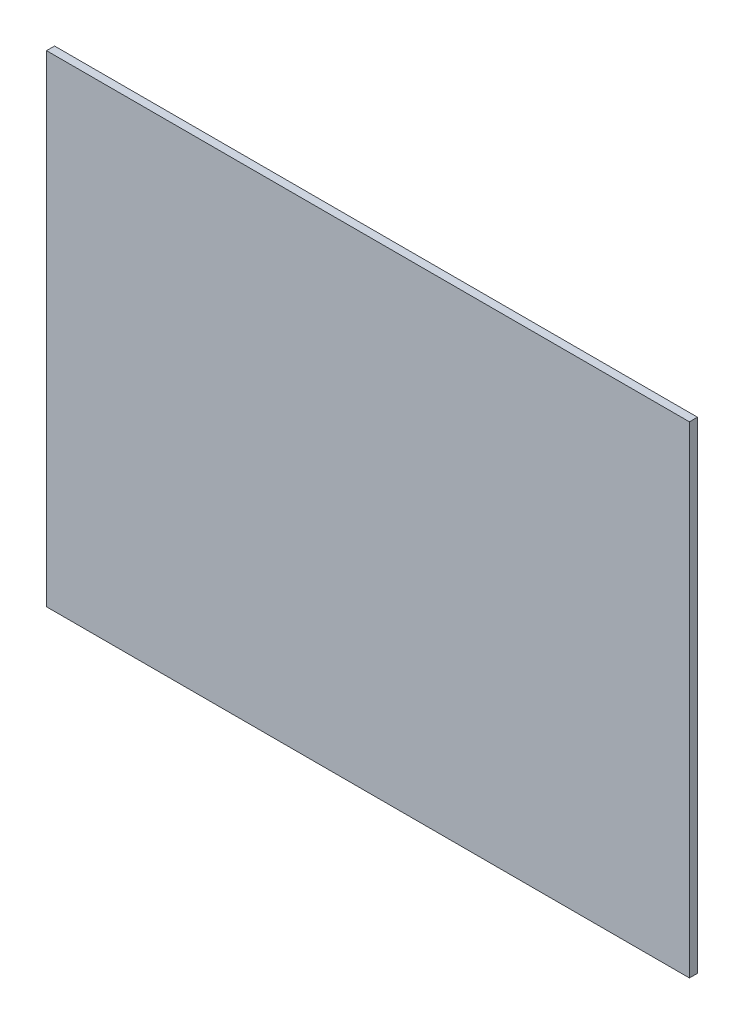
ISO-10303-21;
HEADER;
FILE_DESCRIPTION(('STEP AP214'),'2;1');
FILE_NAME('part.step','',(''),(''),'','','');
FILE_SCHEMA(('AUTOMOTIVE_DESIGN { 1 0 10303 214 1 1 1 1 }'));
ENDSEC;
DATA;
#1=APPLICATION_CONTEXT('core data for automotive mechanical design processes');
#2=APPLICATION_PROTOCOL_DEFINITION('international standard','automotive_design',2000,#1);
#3=PRODUCT_CONTEXT('',#1,'mechanical');
#4=PRODUCT('Part','Part','',(#3));
#5=PRODUCT_RELATED_PRODUCT_CATEGORY('part','',(#4));
#6=PRODUCT_DEFINITION_FORMATION('','',#4);
#7=PRODUCT_DEFINITION_CONTEXT('part definition',#1,'design');
#8=PRODUCT_DEFINITION('design','',#6,#7);
#9=PRODUCT_DEFINITION_SHAPE('','',#8);
#10=(LENGTH_UNIT() NAMED_UNIT(*) SI_UNIT(.MILLI.,.METRE.));
#11=(NAMED_UNIT(*) PLANE_ANGLE_UNIT() SI_UNIT($,.RADIAN.));
#12=(NAMED_UNIT(*) SI_UNIT($,.STERADIAN.) SOLID_ANGLE_UNIT());
#13=UNCERTAINTY_MEASURE_WITH_UNIT(LENGTH_MEASURE(1.E-05),#10,'distance_accuracy_value','');
#14=(GEOMETRIC_REPRESENTATION_CONTEXT(3) GLOBAL_UNCERTAINTY_ASSIGNED_CONTEXT((#13)) GLOBAL_UNIT_ASSIGNED_CONTEXT((#10,
#11,#12)) REPRESENTATION_CONTEXT('',''));
#15=CARTESIAN_POINT('',(0.,0.,0.));
#16=DIRECTION('',(0.,0.,1.));
#17=DIRECTION('',(1.,0.,0.));
#18=AXIS2_PLACEMENT_3D('',#15,#16,#17);
#19=CARTESIAN_POINT('',(0.40005254,0.29972254,0.));
#20=DIRECTION('',(1.,0.,0.));
#21=DIRECTION('',(0.,1.,0.));
#22=AXIS2_PLACEMENT_3D('',#19,#20,#21);
#23=PLANE('',#22);
#24=DIRECTION('',(0.,0.,1.));
#25=VECTOR('',#24,1.);
#26=CARTESIAN_POINT('',(0.40005254,0.29972254,0.));
#27=LINE('',#26,#25);
#28=CARTESIAN_POINT('',(0.40005254,0.29972254,0.));
#29=VERTEX_POINT('',#28);
#30=CARTESIAN_POINT('',(0.40005254,0.29972254,0.00999998));
#31=VERTEX_POINT('',#30);
#32=EDGE_CURVE('E11',#29,#31,#27,.T.);
#33=ORIENTED_EDGE('',*,*,#32,.T.);
#34=DIRECTION('',(0.,-1.,0.));
#35=VECTOR('',#34,1.);
#36=CARTESIAN_POINT('',(0.40005254,0.29972254,0.00999998));
#37=LINE('',#36,#35);
#38=CARTESIAN_POINT('',(0.40005254,-0.29972,0.00999998));
#39=VERTEX_POINT('',#38);
#40=EDGE_CURVE('E45',#31,#39,#37,.T.);
#41=ORIENTED_EDGE('',*,*,#40,.T.);
#42=DIRECTION('',(0.,0.,1.));
#43=VECTOR('',#42,1.);
#44=CARTESIAN_POINT('',(0.40005254,-0.29972,0.));
#45=LINE('',#44,#43);
#46=CARTESIAN_POINT('',(0.40005254,-0.29972,0.));
#47=VERTEX_POINT('',#46);
#48=EDGE_CURVE('E85',#47,#39,#45,.T.);
#49=ORIENTED_EDGE('',*,*,#48,.F.);
#50=DIRECTION('',(0.,-1.,0.));
#51=VECTOR('',#50,1.);
#52=CARTESIAN_POINT('',(0.40005254,0.29972254,0.));
#53=LINE('',#52,#51);
#54=EDGE_CURVE('E80',#29,#47,#53,.T.);
#55=ORIENTED_EDGE('',*,*,#54,.F.);
#56=EDGE_LOOP('',(#33,#41,#49,#55));
#57=FACE_BOUND('',#56,.T.);
#58=ADVANCED_FACE('F17',(#57),#23,.T.);
#59=CARTESIAN_POINT('',(-0.40005,0.29972254,0.));
#60=DIRECTION('',(0.,1.,0.));
#61=DIRECTION('',(1.,0.,0.));
#62=AXIS2_PLACEMENT_3D('',#59,#60,#61);
#63=PLANE('',#62);
#64=DIRECTION('',(0.,0.,1.));
#65=VECTOR('',#64,1.);
#66=CARTESIAN_POINT('',(-0.40005,0.29972254,0.));
#67=LINE('',#66,#65);
#68=CARTESIAN_POINT('',(-0.40005,0.29972254,0.));
#69=VERTEX_POINT('',#68);
#70=CARTESIAN_POINT('',(-0.40005,0.29972254,0.00999998));
#71=VERTEX_POINT('',#70);
#72=EDGE_CURVE('E93',#69,#71,#67,.T.);
#73=ORIENTED_EDGE('',*,*,#72,.T.);
#74=DIRECTION('',(1.,0.,0.));
#75=VECTOR('',#74,1.);
#76=CARTESIAN_POINT('',(-0.40005,0.29972254,0.00999998));
#77=LINE('',#76,#75);
#78=EDGE_CURVE('E20',#71,#31,#77,.T.);
#79=ORIENTED_EDGE('',*,*,#78,.T.);
#80=ORIENTED_EDGE('',*,*,#32,.F.);
#81=DIRECTION('',(1.,0.,0.));
#82=VECTOR('',#81,1.);
#83=CARTESIAN_POINT('',(-0.40005,0.29972254,0.));
#84=LINE('',#83,#82);
#85=EDGE_CURVE('E95',#69,#29,#84,.T.);
#86=ORIENTED_EDGE('',*,*,#85,.F.);
#87=EDGE_LOOP('',(#73,#79,#80,#86));
#88=FACE_BOUND('',#87,.T.);
#89=ADVANCED_FACE('F209',(#88),#63,.T.);
#90=CARTESIAN_POINT('',(2.539994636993E-06,1.813957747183E-06,0.00999998));
#91=DIRECTION('',(0.,0.,-1.));
#92=DIRECTION('',(0.,-1.,0.));
#93=AXIS2_PLACEMENT_3D('',#90,#91,#92);
#94=PLANE('',#93);
#95=DIRECTION('',(-1.,0.,0.));
#96=VECTOR('',#95,1.);
#97=CARTESIAN_POINT('',(0.40005254,-0.29972,0.00999998));
#98=LINE('',#97,#96);
#99=CARTESIAN_POINT('',(-0.40004492,-0.29972,0.00999998));
#100=VERTEX_POINT('',#99);
#101=EDGE_CURVE('E98',#39,#100,#98,.T.);
#102=ORIENTED_EDGE('',*,*,#101,.F.);
#103=ORIENTED_EDGE('',*,*,#40,.F.);
#104=ORIENTED_EDGE('',*,*,#78,.F.);
#105=DIRECTION('',(-8.47454039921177E-06,0.999999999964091,0.));
#106=VECTOR('',#105,1.);
#107=CARTESIAN_POINT('',(-0.40004492,-0.29972,0.00999998));
#108=LINE('',#107,#106);
#109=EDGE_CURVE('E101',#100,#71,#108,.T.);
#110=ORIENTED_EDGE('',*,*,#109,.F.);
#111=EDGE_LOOP('',(#102,#103,#104,#110));
#112=FACE_BOUND('',#111,.T.);
#113=ADVANCED_FACE('F201',(#112),#94,.F.);
#114=CARTESIAN_POINT('',(0.40005254,-0.29972,0.));
#115=DIRECTION('',(0.,-1.,0.));
#116=DIRECTION('',(0.,0.,-1.));
#117=AXIS2_PLACEMENT_3D('',#114,#115,#116);
#118=PLANE('',#117);
#119=ORIENTED_EDGE('',*,*,#48,.T.);
#120=ORIENTED_EDGE('',*,*,#101,.T.);
#121=DIRECTION('',(0.,0.,1.));
#122=VECTOR('',#121,1.);
#123=CARTESIAN_POINT('',(-0.40004492,-0.29972,0.));
#124=LINE('',#123,#122);
#125=CARTESIAN_POINT('',(-0.40004492,-0.29972,0.));
#126=VERTEX_POINT('',#125);
#127=EDGE_CURVE('E91',#126,#100,#124,.T.);
#128=ORIENTED_EDGE('',*,*,#127,.F.);
#129=DIRECTION('',(-1.,0.,0.));
#130=VECTOR('',#129,1.);
#131=CARTESIAN_POINT('',(0.40005254,-0.29972,0.));
#132=LINE('',#131,#130);
#133=EDGE_CURVE('E74',#47,#126,#132,.T.);
#134=ORIENTED_EDGE('',*,*,#133,.F.);
#135=EDGE_LOOP('',(#119,#120,#128,#134));
#136=FACE_BOUND('',#135,.T.);
#137=ADVANCED_FACE('F97',(#136),#118,.T.);
#138=CARTESIAN_POINT('',(2.539994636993E-06,1.813957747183E-06,0.));
#139=DIRECTION('',(0.,0.,-1.));
#140=DIRECTION('',(0.,-1.,0.));
#141=AXIS2_PLACEMENT_3D('',#138,#139,#140);
#142=PLANE('',#141);
#143=DIRECTION('',(-8.47454039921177E-06,0.999999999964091,0.));
#144=VECTOR('',#143,1.);
#145=CARTESIAN_POINT('',(-0.40004492,-0.29972,0.));
#146=LINE('',#145,#144);
#147=EDGE_CURVE('E78',#126,#69,#146,.T.);
#148=ORIENTED_EDGE('',*,*,#147,.T.);
#149=ORIENTED_EDGE('',*,*,#85,.T.);
#150=ORIENTED_EDGE('',*,*,#54,.T.);
#151=ORIENTED_EDGE('',*,*,#133,.T.);
#152=EDGE_LOOP('',(#148,#149,#150,#151));
#153=FACE_BOUND('',#152,.T.);
#154=ADVANCED_FACE('F76',(#153),#142,.T.);
#155=CARTESIAN_POINT('',(-0.40004492,-0.29972,0.));
#156=DIRECTION('',(-0.999999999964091,-8.47454039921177E-06,0.));
#157=DIRECTION('',(-8.47454039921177E-06,0.999999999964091,0.));
#158=AXIS2_PLACEMENT_3D('',#155,#156,#157);
#159=PLANE('',#158);
#160=ORIENTED_EDGE('',*,*,#127,.T.);
#161=ORIENTED_EDGE('',*,*,#109,.T.);
#162=ORIENTED_EDGE('',*,*,#72,.F.);
#163=ORIENTED_EDGE('',*,*,#147,.F.);
#164=EDGE_LOOP('',(#160,#161,#162,#163));
#165=FACE_BOUND('',#164,.T.);
#166=ADVANCED_FACE('F89',(#165),#159,.T.);
#167=CLOSED_SHELL('',(#58,#89,#113,#137,#154,#166));
#168=MANIFOLD_SOLID_BREP('B1',#167);
#169=ADVANCED_BREP_SHAPE_REPRESENTATION('',(#18,#168),#14);
#170=SHAPE_DEFINITION_REPRESENTATION(#9,#169);
ENDSEC;
END-ISO-10303-21;
